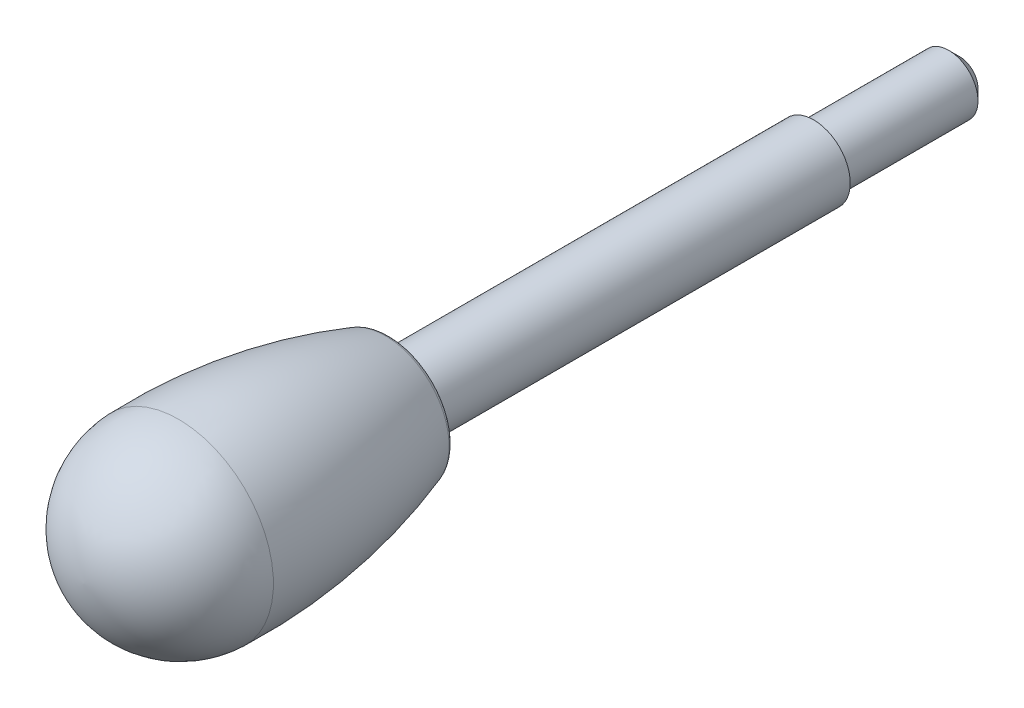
ISO-10303-21;
HEADER;
FILE_DESCRIPTION(('STEP AP214'),'2;1');
FILE_NAME('part.step','',(''),(''),'','','');
FILE_SCHEMA(('AUTOMOTIVE_DESIGN { 1 0 10303 214 1 1 1 1 }'));
ENDSEC;
DATA;
#1=APPLICATION_CONTEXT('core data for automotive mechanical design processes');
#2=APPLICATION_PROTOCOL_DEFINITION('international standard','automotive_design',2000,#1);
#3=PRODUCT_CONTEXT('',#1,'mechanical');
#4=PRODUCT('Part','Part','',(#3));
#5=PRODUCT_RELATED_PRODUCT_CATEGORY('part','',(#4));
#6=PRODUCT_DEFINITION_FORMATION('','',#4);
#7=PRODUCT_DEFINITION_CONTEXT('part definition',#1,'design');
#8=PRODUCT_DEFINITION('design','',#6,#7);
#9=PRODUCT_DEFINITION_SHAPE('','',#8);
#10=(LENGTH_UNIT() NAMED_UNIT(*) SI_UNIT(.MILLI.,.METRE.));
#11=(NAMED_UNIT(*) PLANE_ANGLE_UNIT() SI_UNIT($,.RADIAN.));
#12=(NAMED_UNIT(*) SI_UNIT($,.STERADIAN.) SOLID_ANGLE_UNIT());
#13=UNCERTAINTY_MEASURE_WITH_UNIT(LENGTH_MEASURE(1.E-05),#10,'distance_accuracy_value','');
#14=(GEOMETRIC_REPRESENTATION_CONTEXT(3) GLOBAL_UNCERTAINTY_ASSIGNED_CONTEXT((#13)) GLOBAL_UNIT_ASSIGNED_CONTEXT((#10,
#11,#12)) REPRESENTATION_CONTEXT('',''));
#15=CARTESIAN_POINT('',(0.,0.,0.));
#16=DIRECTION('',(0.,0.,1.));
#17=DIRECTION('',(1.,0.,0.));
#18=AXIS2_PLACEMENT_3D('',#15,#16,#17);
#19=CARTESIAN_POINT('',(0.,5.,0.));
#20=DIRECTION('',(0.,0.,1.));
#21=DIRECTION('',(1.,0.,0.));
#22=AXIS2_PLACEMENT_3D('',#19,#20,#21);
#23=PLANE('',#22);
#24=CARTESIAN_POINT('',(0.,0.,0.));
#25=DIRECTION('',(0.,0.,-1.));
#26=DIRECTION('',(-1.,0.,0.));
#27=AXIS2_PLACEMENT_3D('',#24,#25,#26);
#28=CIRCLE('',#27,4.);
#29=CARTESIAN_POINT('',(-4.,0.,0.));
#30=VERTEX_POINT('',#29);
#31=EDGE_CURVE('E78',#30,#30,#28,.T.);
#32=ORIENTED_EDGE('',*,*,#31,.F.);
#33=EDGE_LOOP('',(#32));
#34=FACE_BOUND('',#33,.T.);
#35=CARTESIAN_POINT('',(0.,0.,0.));
#36=DIRECTION('',(0.,0.,-1.));
#37=DIRECTION('',(-1.,0.,0.));
#38=AXIS2_PLACEMENT_3D('',#35,#36,#37);
#39=CIRCLE('',#38,5.);
#40=CARTESIAN_POINT('',(-5.,0.,0.));
#41=VERTEX_POINT('',#40);
#42=EDGE_CURVE('E9',#41,#41,#39,.T.);
#43=ORIENTED_EDGE('',*,*,#42,.T.);
#44=EDGE_LOOP('',(#43));
#45=FACE_BOUND('',#44,.T.);
#46=ADVANCED_FACE('F14',(#34,#45),#23,.F.);
#47=CARTESIAN_POINT('',(0.,0.,-32.0353600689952));
#48=DIRECTION('',(0.,0.,-1.));
#49=DIRECTION('',(-1.,0.,0.));
#50=AXIS2_PLACEMENT_3D('',#47,#48,#49);
#51=CYLINDRICAL_SURFACE('',#50,5.);
#52=ORIENTED_EDGE('',*,*,#42,.F.);
#53=EDGE_LOOP('',(#52));
#54=FACE_BOUND('',#53,.T.);
#55=CARTESIAN_POINT('',(0.,0.,58.));
#56=DIRECTION('',(0.,0.,-1.));
#57=DIRECTION('',(-1.,0.,0.));
#58=AXIS2_PLACEMENT_3D('',#55,#56,#57);
#59=CIRCLE('',#58,4.99999999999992);
#60=CARTESIAN_POINT('',(-4.99999999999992,0.,58.));
#61=VERTEX_POINT('',#60);
#62=EDGE_CURVE('E20',#61,#61,#59,.T.);
#63=ORIENTED_EDGE('',*,*,#62,.T.);
#64=EDGE_LOOP('',(#63));
#65=FACE_BOUND('',#64,.T.);
#66=ADVANCED_FACE('F48',(#54,#65),#51,.T.);
#67=CARTESIAN_POINT('',(0.,7.78846659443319,58.));
#68=DIRECTION('',(0.,0.,1.));
#69=DIRECTION('',(1.,0.,0.));
#70=AXIS2_PLACEMENT_3D('',#67,#68,#69);
#71=PLANE('',#70);
#72=ORIENTED_EDGE('',*,*,#62,.F.);
#73=EDGE_LOOP('',(#72));
#74=FACE_BOUND('',#73,.T.);
#75=CARTESIAN_POINT('',(0.,0.,58.));
#76=DIRECTION('',(0.,0.,-1.));
#77=DIRECTION('',(-1.,0.,0.));
#78=AXIS2_PLACEMENT_3D('',#75,#76,#77);
#79=CIRCLE('',#78,7.78846659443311);
#80=CARTESIAN_POINT('',(-7.78846659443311,0.,58.));
#81=VERTEX_POINT('',#80);
#82=EDGE_CURVE('E37',#81,#81,#79,.T.);
#83=ORIENTED_EDGE('',*,*,#82,.T.);
#84=EDGE_LOOP('',(#83));
#85=FACE_BOUND('',#84,.T.);
#86=ADVANCED_FACE('F50',(#74,#85),#71,.F.);
#87=CARTESIAN_POINT('',(0.,0.,59.));
#88=DIRECTION('',(0.,0.,-1.));
#89=DIRECTION('',(-1.,0.,0.));
#90=AXIS2_PLACEMENT_3D('',#87,#88,#89);
#91=TOROIDAL_SURFACE('',#90,7.78846659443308,0.999999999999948);
#92=ORIENTED_EDGE('',*,*,#82,.F.);
#93=EDGE_LOOP('',(#92));
#94=FACE_BOUND('',#93,.T.);
#95=CARTESIAN_POINT('',(0.,0.,58.6764699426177));
#96=DIRECTION('',(0.,0.,-1.));
#97=DIRECTION('',(-1.,0.,0.));
#98=AXIS2_PLACEMENT_3D('',#95,#96,#97);
#99=CIRCLE('',#98,8.73468448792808);
#100=CARTESIAN_POINT('',(-8.73468448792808,0.,58.6764699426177));
#101=VERTEX_POINT('',#100);
#102=EDGE_CURVE('E33',#101,#101,#99,.T.);
#103=ORIENTED_EDGE('',*,*,#102,.T.);
#104=EDGE_LOOP('',(#103));
#105=FACE_BOUND('',#104,.T.);
#106=ADVANCED_FACE('F53',(#94,#105),#91,.T.);
#107=CARTESIAN_POINT('',(0.,0.,84.5588745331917));
#108=DIRECTION('',(0.,0.,-1.));
#109=DIRECTION('',(-1.,0.,0.));
#110=AXIS2_PLACEMENT_3D('',#107,#108,#109);
#111=DEGENERATE_TOROIDAL_SURFACE('',#110,66.9627469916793,80.,.F.);
#112=ORIENTED_EDGE('',*,*,#102,.F.);
#113=EDGE_LOOP('',(#112));
#114=FACE_BOUND('',#113,.T.);
#115=CARTESIAN_POINT('',(0.,0.,87.));
#116=DIRECTION('',(0.,0.,-1.));
#117=DIRECTION('',(-1.,0.,0.));
#118=AXIS2_PLACEMENT_3D('',#115,#116,#117);
#119=CIRCLE('',#118,13.);
#120=CARTESIAN_POINT('',(-13.,0.,87.));
#121=VERTEX_POINT('',#120);
#122=EDGE_CURVE('E31',#121,#121,#119,.T.);
#123=ORIENTED_EDGE('',*,*,#122,.T.);
#124=EDGE_LOOP('',(#123));
#125=FACE_BOUND('',#124,.T.);
#126=ADVANCED_FACE('F27',(#114,#125),#111,.F.);
#127=CARTESIAN_POINT('',(0.40936490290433,0.,86.5906350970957));
#128=DIRECTION('',(0.,-1.,0.));
#129=DIRECTION('',(-1.,0.,0.));
#130=AXIS2_PLACEMENT_3D('',#127,#128,#129);
#131=CIRCLE('',#130,13.4156120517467);
#132=TRIMMED_CURVE('',#131,(PARAMETER_VALUE(-1.54027752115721)),
(PARAMETER_VALUE(1.54027752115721)),.T.,.PARAMETER.);
#133=CARTESIAN_POINT('',(0.,0.,86.5906350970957));
#134=DIRECTION('',(0.,0.,-1.));
#135=AXIS1_PLACEMENT('',#133,#134);
#136=SURFACE_OF_REVOLUTION('',#132,#135);
#137=CARTESIAN_POINT('',(0.,0.,100.));
#138=VERTEX_POINT('',#137);
#139=VERTEX_LOOP('',#138);
#140=FACE_BOUND('',#139,.T.);
#141=ORIENTED_EDGE('',*,*,#122,.F.);
#142=EDGE_LOOP('',(#141));
#143=FACE_BOUND('',#142,.T.);
#144=ADVANCED_FACE('F23',(#140,#143),#136,.T.);
#145=CARTESIAN_POINT('',(0.,2.49999999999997,-20.));
#146=DIRECTION('',(0.,0.,1.));
#147=DIRECTION('',(1.,0.,0.));
#148=AXIS2_PLACEMENT_3D('',#145,#146,#147);
#149=PLANE('',#148);
#150=CARTESIAN_POINT('',(0.,0.,-20.));
#151=DIRECTION('',(0.,0.,-1.));
#152=DIRECTION('',(-1.,0.,0.));
#153=AXIS2_PLACEMENT_3D('',#150,#151,#152);
#154=CIRCLE('',#153,2.5);
#155=CARTESIAN_POINT('',(-2.5,0.,-20.));
#156=VERTEX_POINT('',#155);
#157=EDGE_CURVE('E34',#156,#156,#154,.T.);
#158=ORIENTED_EDGE('',*,*,#157,.T.);
#159=EDGE_LOOP('',(#158));
#160=FACE_BOUND('',#159,.T.);
#161=ADVANCED_FACE('F26',(#160),#149,.F.);
#162=CARTESIAN_POINT('',(0.,0.,-18.5));
#163=DIRECTION('',(0.,0.,1.));
#164=DIRECTION('',(1.,0.,0.));
#165=AXIS2_PLACEMENT_3D('',#162,#163,#164);
#166=CONICAL_SURFACE('',#165,4.,0.785398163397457);
#167=ORIENTED_EDGE('',*,*,#157,.F.);
#168=EDGE_LOOP('',(#167));
#169=FACE_BOUND('',#168,.T.);
#170=CARTESIAN_POINT('',(0.,0.,-18.5));
#171=DIRECTION('',(0.,0.,-1.));
#172=DIRECTION('',(-1.,0.,0.));
#173=AXIS2_PLACEMENT_3D('',#170,#171,#172);
#174=CIRCLE('',#173,4.);
#175=CARTESIAN_POINT('',(-4.,0.,-18.5));
#176=VERTEX_POINT('',#175);
#177=EDGE_CURVE('E40',#176,#176,#174,.T.);
#178=ORIENTED_EDGE('',*,*,#177,.T.);
#179=EDGE_LOOP('',(#178));
#180=FACE_BOUND('',#179,.T.);
#181=ADVANCED_FACE('F85',(#169,#180),#166,.T.);
#182=CARTESIAN_POINT('',(0.,0.,-32.0353600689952));
#183=DIRECTION('',(0.,0.,-1.));
#184=DIRECTION('',(-1.,0.,0.));
#185=AXIS2_PLACEMENT_3D('',#182,#183,#184);
#186=CYLINDRICAL_SURFACE('',#185,4.);
#187=ORIENTED_EDGE('',*,*,#177,.F.);
#188=EDGE_LOOP('',(#187));
#189=FACE_BOUND('',#188,.T.);
#190=ORIENTED_EDGE('',*,*,#31,.T.);
#191=EDGE_LOOP('',(#190));
#192=FACE_BOUND('',#191,.T.);
#193=ADVANCED_FACE('F87',(#189,#192),#186,.T.);
#194=CLOSED_SHELL('',(#46,#66,#86,#106,#126,#144,#161,#181,#193));
#195=MANIFOLD_SOLID_BREP('B1',#194);
#196=ADVANCED_BREP_SHAPE_REPRESENTATION('',(#18,#195),#14);
#197=SHAPE_DEFINITION_REPRESENTATION(#9,#196);
ENDSEC;
END-ISO-10303-21;
